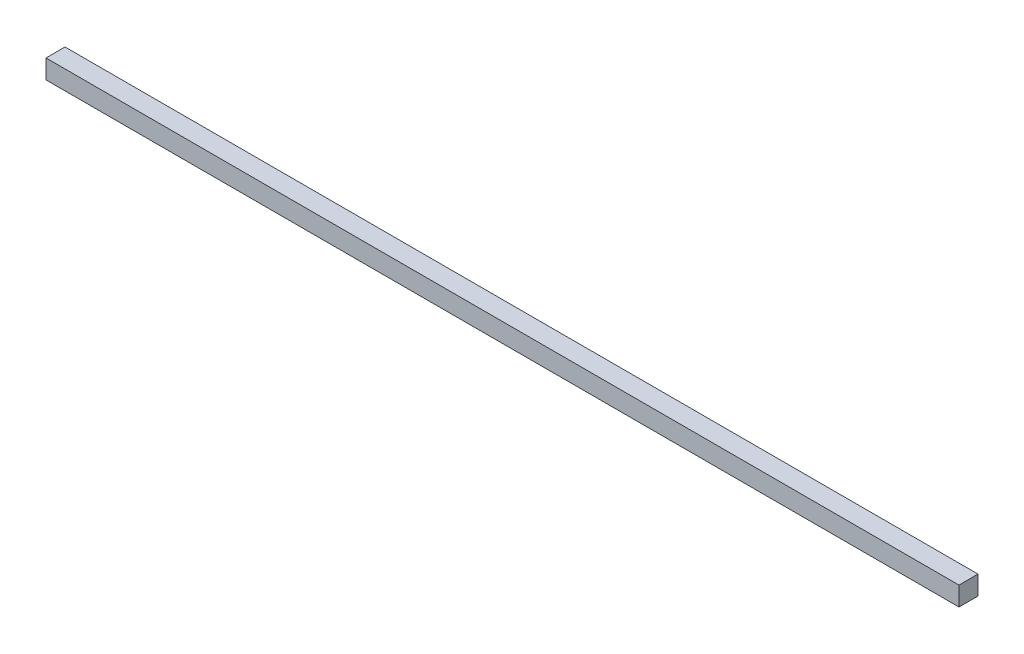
from build123d import *

# Parameters (mm, degrees)
SKETCH1_W           = 304.8
SKETCH1_H           = 6.35
BOSS_EXTRUDE1_DEPTH = 6.35


with BuildPart() as part:
    # Sketch1 → Boss-Extrude1 (new body)
    with BuildSketch(Plane.XY):
        with Locations((94.096790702, 16.666898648)):
            Rectangle(SKETCH1_W, SKETCH1_H)
    extrude(amount=BOSS_EXTRUDE1_DEPTH)


solid = part.part
